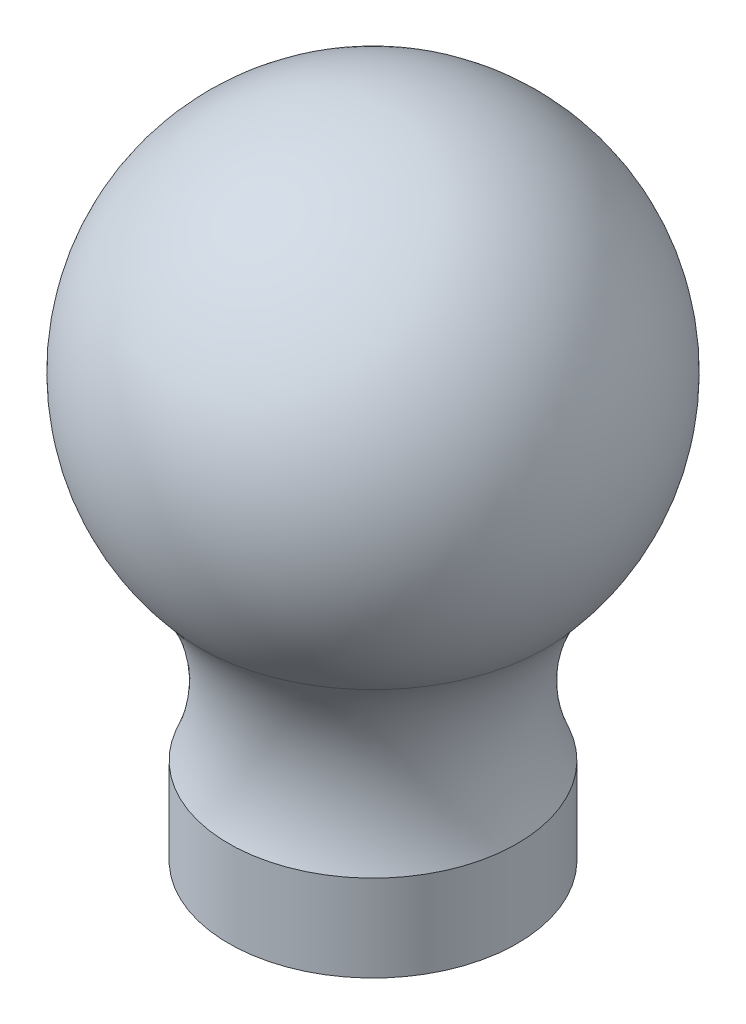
from build123d import *

# Parameters (mm, degrees)
SKETCH_2_R          = 1.875
CUT_EXTRUDE_1_DEPTH = 20


with BuildPart() as part:
    # Sketch 1 → Revolve 1 (revolve)
    with BuildSketch(Plane.XY, mode=Mode.PRIVATE) as revolve_1_sk:
        with BuildLine():
            Line((0, 0), (5, 0))
            Line((5, 0), (5, 3))
            ThreePointArc((5, 3), (4.572672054, 6.328927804), (6, 9.366542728))
            ThreePointArc((6, 9.366542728), (7.291502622, 17.949547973), (0, 22.65804535))
            Line((0, 22.65804535), (0, 0))
        make_face()
    revolve(revolve_1_sk.sketch.rotate(Axis((0, 0, 0), (0, 1, 0)), 90), axis=Axis((0, 0, 0), (0, 1, 0)))

    # Sketch 2 → Cut-Extrude 1 (cut)
    with BuildSketch(Plane.XZ):
        with Locations(Location((0, 0, 0), (0, 0, 270))):
            Circle(SKETCH_2_R)
    extrude(amount=-CUT_EXTRUDE_1_DEPTH, mode=Mode.SUBTRACT)


solid = part.part
